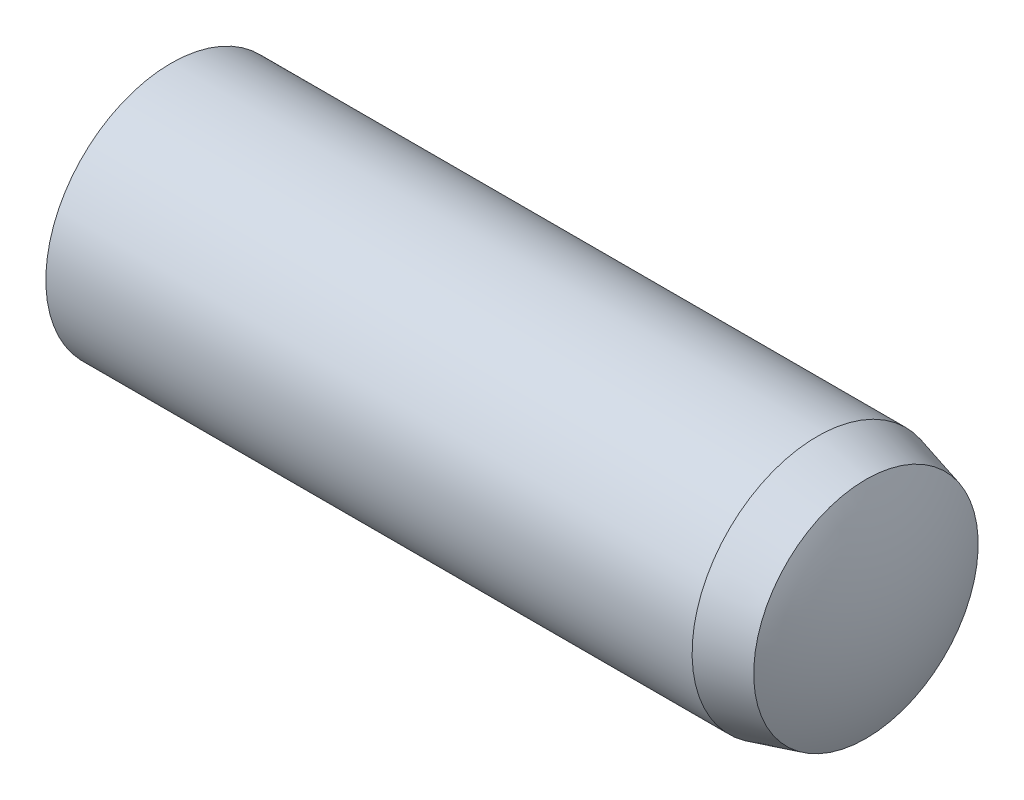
from build123d import *


with BuildPart() as part:
    # BodySke → Body (revolve)
    with BuildSketch(Plane.XY, mode=Mode.PRIVATE) as body_sk:
        with BuildLine():
            Line((27, 5), (28.94028425, 4.480102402))
            ThreePointArc((28.94028425, 4.480102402), (29.731465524, 2.30186419), (30, 0))
            Line((30, 0), (0, 0))
            ThreePointArc((0, 0), (0.30419989, 2.570992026), (1.2, 5))
            Line((1.2, 5), (27, 5))
        make_face()
    revolve(body_sk.sketch.rotate(Axis((0, 0, 0), (1, 0, 0)), 180), axis=Axis((0, 0, 0), (1, 0, 0)))


solid = part.part
